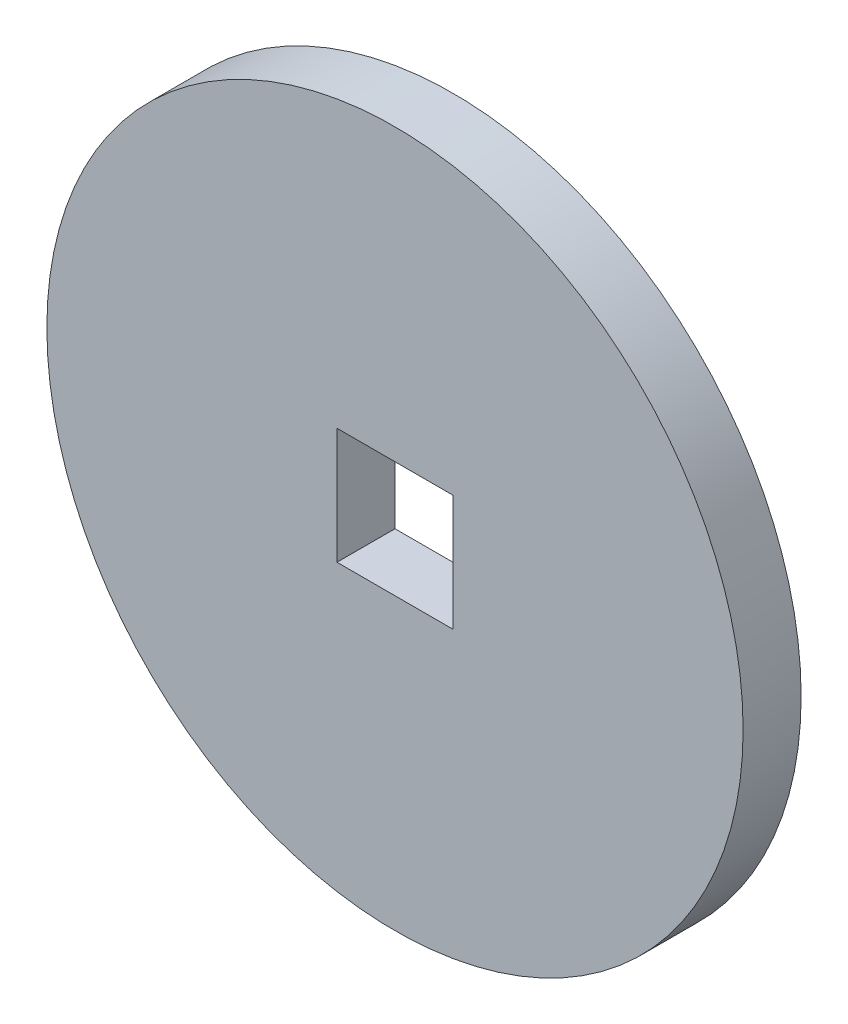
ISO-10303-21;
HEADER;
FILE_DESCRIPTION(('STEP AP214'),'2;1');
FILE_NAME('part.step','',(''),(''),'','','');
FILE_SCHEMA(('AUTOMOTIVE_DESIGN { 1 0 10303 214 1 1 1 1 }'));
ENDSEC;
DATA;
#1=APPLICATION_CONTEXT('core data for automotive mechanical design processes');
#2=APPLICATION_PROTOCOL_DEFINITION('international standard','automotive_design',2000,#1);
#3=PRODUCT_CONTEXT('',#1,'mechanical');
#4=PRODUCT('Part','Part','',(#3));
#5=PRODUCT_RELATED_PRODUCT_CATEGORY('part','',(#4));
#6=PRODUCT_DEFINITION_FORMATION('','',#4);
#7=PRODUCT_DEFINITION_CONTEXT('part definition',#1,'design');
#8=PRODUCT_DEFINITION('design','',#6,#7);
#9=PRODUCT_DEFINITION_SHAPE('','',#8);
#10=(LENGTH_UNIT() NAMED_UNIT(*) SI_UNIT(.MILLI.,.METRE.));
#11=(NAMED_UNIT(*) PLANE_ANGLE_UNIT() SI_UNIT($,.RADIAN.));
#12=(NAMED_UNIT(*) SI_UNIT($,.STERADIAN.) SOLID_ANGLE_UNIT());
#13=UNCERTAINTY_MEASURE_WITH_UNIT(LENGTH_MEASURE(1.E-05),#10,'distance_accuracy_value','');
#14=(GEOMETRIC_REPRESENTATION_CONTEXT(3) GLOBAL_UNCERTAINTY_ASSIGNED_CONTEXT((#13)) GLOBAL_UNIT_ASSIGNED_CONTEXT((#10,
#11,#12)) REPRESENTATION_CONTEXT('',''));
#15=CARTESIAN_POINT('',(0.,0.,0.));
#16=DIRECTION('',(0.,0.,1.));
#17=DIRECTION('',(1.,0.,0.));
#18=AXIS2_PLACEMENT_3D('',#15,#16,#17);
#19=CARTESIAN_POINT('',(-39.706070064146,27.7633159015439,3.175));
#20=DIRECTION('',(0.,0.,1.));
#21=DIRECTION('',(1.,0.,0.));
#22=AXIS2_PLACEMENT_3D('',#19,#20,#21);
#23=PLANE('',#22);
#24=CARTESIAN_POINT('',(-39.706070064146,27.7633159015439,3.175));
#25=DIRECTION('',(0.,0.,1.));
#26=DIRECTION('',(1.,0.,0.));
#27=AXIS2_PLACEMENT_3D('',#24,#25,#26);
#28=CIRCLE('',#27,19.05);
#29=CARTESIAN_POINT('',(-20.656070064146,27.7633159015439,3.175));
#30=VERTEX_POINT('',#29);
#31=EDGE_CURVE('E11',#30,#30,#28,.T.);
#32=ORIENTED_EDGE('',*,*,#31,.T.);
#33=EDGE_LOOP('',(#32));
#34=FACE_BOUND('',#33,.T.);
#35=DIRECTION('',(-1.,0.,0.));
#36=VECTOR('',#35,1.);
#37=CARTESIAN_POINT('',(-42.881070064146,30.9383159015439,3.175));
#38=LINE('',#37,#36);
#39=CARTESIAN_POINT('',(-36.531070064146,30.9383159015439,3.175));
#40=VERTEX_POINT('',#39);
#41=CARTESIAN_POINT('',(-42.881070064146,30.9383159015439,3.175));
#42=VERTEX_POINT('',#41);
#43=EDGE_CURVE('E82',#40,#42,#38,.T.);
#44=ORIENTED_EDGE('',*,*,#43,.F.);
#45=DIRECTION('',(0.,1.,0.));
#46=VECTOR('',#45,1.);
#47=CARTESIAN_POINT('',(-36.531070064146,24.5883159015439,3.175));
#48=LINE('',#47,#46);
#49=CARTESIAN_POINT('',(-36.531070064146,24.5883159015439,3.175));
#50=VERTEX_POINT('',#49);
#51=EDGE_CURVE('E74',#50,#40,#48,.T.);
#52=ORIENTED_EDGE('',*,*,#51,.F.);
#53=DIRECTION('',(1.,0.,0.));
#54=VECTOR('',#53,1.);
#55=CARTESIAN_POINT('',(-42.881070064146,24.5883159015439,3.175));
#56=LINE('',#55,#54);
#57=CARTESIAN_POINT('',(-42.881070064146,24.5883159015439,3.175));
#58=VERTEX_POINT('',#57);
#59=EDGE_CURVE('E95',#58,#50,#56,.T.);
#60=ORIENTED_EDGE('',*,*,#59,.F.);
#61=DIRECTION('',(0.,-1.,0.));
#62=VECTOR('',#61,1.);
#63=CARTESIAN_POINT('',(-42.881070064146,24.5883159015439,3.175));
#64=LINE('',#63,#62);
#65=EDGE_CURVE('E93',#42,#58,#64,.T.);
#66=ORIENTED_EDGE('',*,*,#65,.F.);
#67=EDGE_LOOP('',(#44,#52,#60,#66));
#68=FACE_BOUND('',#67,.T.);
#69=ADVANCED_FACE('F33',(#34,#68),#23,.T.);
#70=CARTESIAN_POINT('',(-39.706070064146,27.7633159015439,0.));
#71=DIRECTION('',(0.,0.,1.));
#72=DIRECTION('',(1.,0.,0.));
#73=AXIS2_PLACEMENT_3D('',#70,#71,#72);
#74=PLANE('',#73);
#75=CARTESIAN_POINT('',(-39.706070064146,27.7633159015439,0.));
#76=DIRECTION('',(0.,0.,1.));
#77=DIRECTION('',(1.,0.,0.));
#78=AXIS2_PLACEMENT_3D('',#75,#76,#77);
#79=CIRCLE('',#78,19.05);
#80=CARTESIAN_POINT('',(-20.656070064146,27.7633159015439,0.));
#81=VERTEX_POINT('',#80);
#82=EDGE_CURVE('E37',#81,#81,#79,.T.);
#83=ORIENTED_EDGE('',*,*,#82,.F.);
#84=EDGE_LOOP('',(#83));
#85=FACE_BOUND('',#84,.T.);
#86=DIRECTION('',(0.,1.,0.));
#87=VECTOR('',#86,1.);
#88=CARTESIAN_POINT('',(-36.531070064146,24.5883159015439,0.));
#89=LINE('',#88,#87);
#90=CARTESIAN_POINT('',(-36.531070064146,24.5883159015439,0.));
#91=VERTEX_POINT('',#90);
#92=CARTESIAN_POINT('',(-36.531070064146,30.9383159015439,0.));
#93=VERTEX_POINT('',#92);
#94=EDGE_CURVE('E56',#91,#93,#89,.T.);
#95=ORIENTED_EDGE('',*,*,#94,.T.);
#96=DIRECTION('',(-1.,0.,0.));
#97=VECTOR('',#96,1.);
#98=CARTESIAN_POINT('',(-42.881070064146,30.9383159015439,0.));
#99=LINE('',#98,#97);
#100=CARTESIAN_POINT('',(-42.881070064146,30.9383159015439,0.));
#101=VERTEX_POINT('',#100);
#102=EDGE_CURVE('E89',#93,#101,#99,.T.);
#103=ORIENTED_EDGE('',*,*,#102,.T.);
#104=DIRECTION('',(0.,-1.,0.));
#105=VECTOR('',#104,1.);
#106=CARTESIAN_POINT('',(-42.881070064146,24.5883159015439,0.));
#107=LINE('',#106,#105);
#108=CARTESIAN_POINT('',(-42.881070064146,24.5883159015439,0.));
#109=VERTEX_POINT('',#108);
#110=EDGE_CURVE('E101',#101,#109,#107,.T.);
#111=ORIENTED_EDGE('',*,*,#110,.T.);
#112=DIRECTION('',(1.,0.,0.));
#113=VECTOR('',#112,1.);
#114=CARTESIAN_POINT('',(-42.881070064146,24.5883159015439,0.));
#115=LINE('',#114,#113);
#116=EDGE_CURVE('E83',#109,#91,#115,.T.);
#117=ORIENTED_EDGE('',*,*,#116,.T.);
#118=EDGE_LOOP('',(#95,#103,#111,#117));
#119=FACE_BOUND('',#118,.T.);
#120=ADVANCED_FACE('F112',(#85,#119),#74,.F.);
#121=CARTESIAN_POINT('',(-39.706070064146,27.7633159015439,3.175));
#122=DIRECTION('',(0.,0.,-1.));
#123=DIRECTION('',(-1.,0.,0.));
#124=AXIS2_PLACEMENT_3D('',#121,#122,#123);
#125=CYLINDRICAL_SURFACE('',#124,19.05);
#126=ORIENTED_EDGE('',*,*,#31,.F.);
#127=EDGE_LOOP('',(#126));
#128=FACE_BOUND('',#127,.T.);
#129=ORIENTED_EDGE('',*,*,#82,.T.);
#130=EDGE_LOOP('',(#129));
#131=FACE_BOUND('',#130,.T.);
#132=ADVANCED_FACE('F35',(#128,#131),#125,.T.);
#133=CARTESIAN_POINT('',(-36.531070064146,24.5883159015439,3.175));
#134=DIRECTION('',(-1.,0.,0.));
#135=DIRECTION('',(0.,0.,1.));
#136=AXIS2_PLACEMENT_3D('',#133,#134,#135);
#137=PLANE('',#136);
#138=ORIENTED_EDGE('',*,*,#94,.F.);
#139=DIRECTION('',(0.,0.,-1.));
#140=VECTOR('',#139,1.);
#141=CARTESIAN_POINT('',(-36.531070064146,24.5883159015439,3.175));
#142=LINE('',#141,#140);
#143=EDGE_CURVE('E78',#50,#91,#142,.T.);
#144=ORIENTED_EDGE('',*,*,#143,.F.);
#145=ORIENTED_EDGE('',*,*,#51,.T.);
#146=DIRECTION('',(0.,0.,-1.));
#147=VECTOR('',#146,1.);
#148=CARTESIAN_POINT('',(-36.531070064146,30.9383159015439,3.175));
#149=LINE('',#148,#147);
#150=EDGE_CURVE('E77',#40,#93,#149,.T.);
#151=ORIENTED_EDGE('',*,*,#150,.T.);
#152=EDGE_LOOP('',(#138,#144,#145,#151));
#153=FACE_BOUND('',#152,.T.);
#154=ADVANCED_FACE('F76',(#153),#137,.T.);
#155=CARTESIAN_POINT('',(-42.881070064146,30.9383159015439,3.175));
#156=DIRECTION('',(0.,-1.,0.));
#157=DIRECTION('',(0.,0.,-1.));
#158=AXIS2_PLACEMENT_3D('',#155,#156,#157);
#159=PLANE('',#158);
#160=ORIENTED_EDGE('',*,*,#102,.F.);
#161=ORIENTED_EDGE('',*,*,#150,.F.);
#162=ORIENTED_EDGE('',*,*,#43,.T.);
#163=DIRECTION('',(0.,0.,-1.));
#164=VECTOR('',#163,1.);
#165=CARTESIAN_POINT('',(-42.881070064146,30.9383159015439,3.175));
#166=LINE('',#165,#164);
#167=EDGE_CURVE('E90',#42,#101,#166,.T.);
#168=ORIENTED_EDGE('',*,*,#167,.T.);
#169=EDGE_LOOP('',(#160,#161,#162,#168));
#170=FACE_BOUND('',#169,.T.);
#171=ADVANCED_FACE('F86',(#170),#159,.T.);
#172=CARTESIAN_POINT('',(-42.881070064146,24.5883159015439,3.175));
#173=DIRECTION('',(1.,0.,0.));
#174=DIRECTION('',(0.,0.,-1.));
#175=AXIS2_PLACEMENT_3D('',#172,#173,#174);
#176=PLANE('',#175);
#177=ORIENTED_EDGE('',*,*,#110,.F.);
#178=ORIENTED_EDGE('',*,*,#167,.F.);
#179=ORIENTED_EDGE('',*,*,#65,.T.);
#180=DIRECTION('',(0.,0.,-1.));
#181=VECTOR('',#180,1.);
#182=CARTESIAN_POINT('',(-42.881070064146,24.5883159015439,3.175));
#183=LINE('',#182,#181);
#184=EDGE_CURVE('E48',#58,#109,#183,.T.);
#185=ORIENTED_EDGE('',*,*,#184,.T.);
#186=EDGE_LOOP('',(#177,#178,#179,#185));
#187=FACE_BOUND('',#186,.T.);
#188=ADVANCED_FACE('F110',(#187),#176,.T.);
#189=CARTESIAN_POINT('',(-42.881070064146,24.5883159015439,3.175));
#190=DIRECTION('',(0.,1.,0.));
#191=DIRECTION('',(0.,0.,1.));
#192=AXIS2_PLACEMENT_3D('',#189,#190,#191);
#193=PLANE('',#192);
#194=ORIENTED_EDGE('',*,*,#116,.F.);
#195=ORIENTED_EDGE('',*,*,#184,.F.);
#196=ORIENTED_EDGE('',*,*,#59,.T.);
#197=ORIENTED_EDGE('',*,*,#143,.T.);
#198=EDGE_LOOP('',(#194,#195,#196,#197));
#199=FACE_BOUND('',#198,.T.);
#200=ADVANCED_FACE('F113',(#199),#193,.T.);
#201=CLOSED_SHELL('',(#69,#120,#132,#154,#171,#188,#200));
#202=MANIFOLD_SOLID_BREP('B2',#201);
#203=ADVANCED_BREP_SHAPE_REPRESENTATION('',(#18,#202),#14);
#204=SHAPE_DEFINITION_REPRESENTATION(#9,#203);
ENDSEC;
END-ISO-10303-21;
